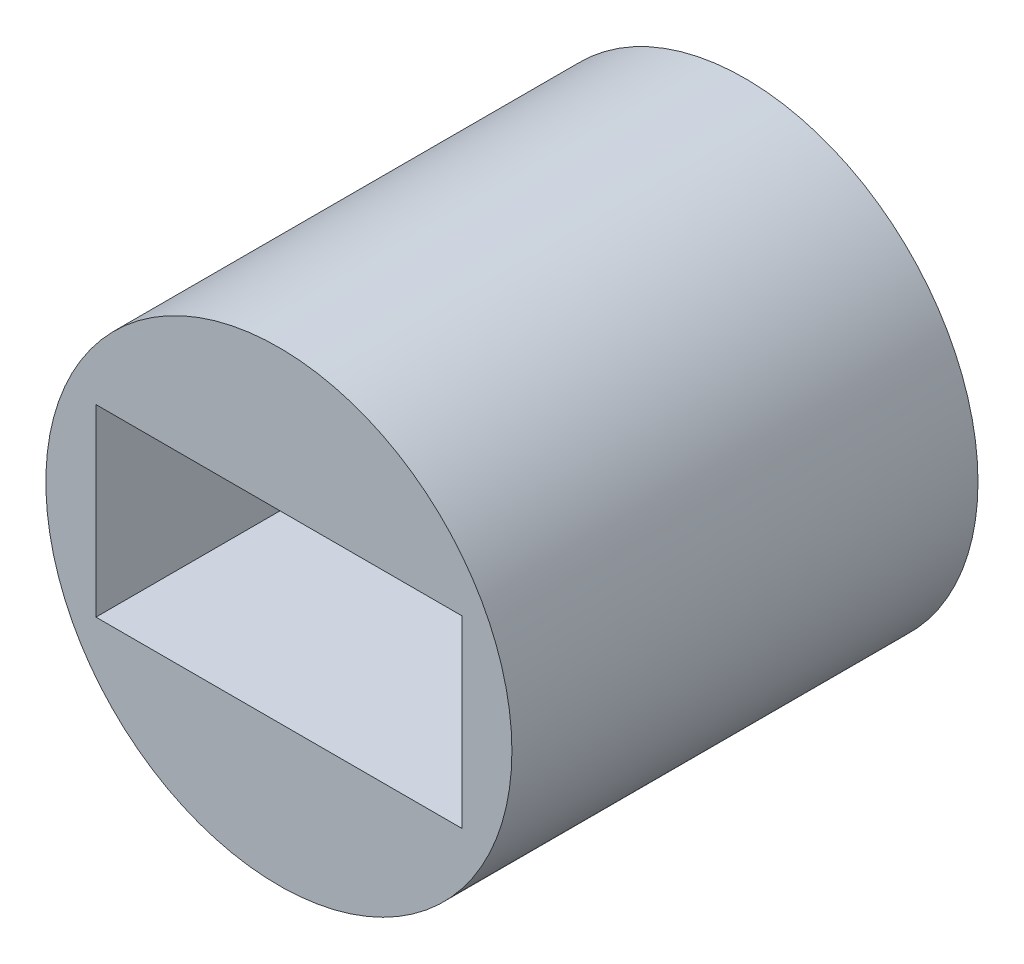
ISO-10303-21;
HEADER;
FILE_DESCRIPTION(('STEP AP214'),'2;1');
FILE_NAME('part.step','',(''),(''),'','','');
FILE_SCHEMA(('AUTOMOTIVE_DESIGN { 1 0 10303 214 1 1 1 1 }'));
ENDSEC;
DATA;
#1=APPLICATION_CONTEXT('core data for automotive mechanical design processes');
#2=APPLICATION_PROTOCOL_DEFINITION('international standard','automotive_design',2000,#1);
#3=PRODUCT_CONTEXT('',#1,'mechanical');
#4=PRODUCT('Part','Part','',(#3));
#5=PRODUCT_RELATED_PRODUCT_CATEGORY('part','',(#4));
#6=PRODUCT_DEFINITION_FORMATION('','',#4);
#7=PRODUCT_DEFINITION_CONTEXT('part definition',#1,'design');
#8=PRODUCT_DEFINITION('design','',#6,#7);
#9=PRODUCT_DEFINITION_SHAPE('','',#8);
#10=(LENGTH_UNIT() NAMED_UNIT(*) SI_UNIT(.MILLI.,.METRE.));
#11=(NAMED_UNIT(*) PLANE_ANGLE_UNIT() SI_UNIT($,.RADIAN.));
#12=(NAMED_UNIT(*) SI_UNIT($,.STERADIAN.) SOLID_ANGLE_UNIT());
#13=UNCERTAINTY_MEASURE_WITH_UNIT(LENGTH_MEASURE(1.E-05),#10,'distance_accuracy_value','');
#14=(GEOMETRIC_REPRESENTATION_CONTEXT(3) GLOBAL_UNCERTAINTY_ASSIGNED_CONTEXT((#13)) GLOBAL_UNIT_ASSIGNED_CONTEXT((#10,
#11,#12)) REPRESENTATION_CONTEXT('',''));
#15=CARTESIAN_POINT('',(0.,0.,0.));
#16=DIRECTION('',(0.,0.,1.));
#17=DIRECTION('',(1.,0.,0.));
#18=AXIS2_PLACEMENT_3D('',#15,#16,#17);
#19=CARTESIAN_POINT('',(0.,0.,50.8));
#20=DIRECTION('',(0.,0.,-1.));
#21=DIRECTION('',(-1.,0.,0.));
#22=AXIS2_PLACEMENT_3D('',#19,#20,#21);
#23=CYLINDRICAL_SURFACE('',#22,25.4);
#24=CARTESIAN_POINT('',(0.,0.,50.8));
#25=DIRECTION('',(0.,0.,1.));
#26=DIRECTION('',(1.,0.,0.));
#27=AXIS2_PLACEMENT_3D('',#24,#25,#26);
#28=CIRCLE('',#27,25.4);
#29=CARTESIAN_POINT('',(25.4,0.,50.8));
#30=VERTEX_POINT('',#29);
#31=EDGE_CURVE('E11',#30,#30,#28,.T.);
#32=ORIENTED_EDGE('',*,*,#31,.F.);
#33=EDGE_LOOP('',(#32));
#34=FACE_BOUND('',#33,.T.);
#35=CARTESIAN_POINT('',(0.,0.,0.));
#36=DIRECTION('',(0.,0.,1.));
#37=DIRECTION('',(1.,0.,0.));
#38=AXIS2_PLACEMENT_3D('',#35,#36,#37);
#39=CIRCLE('',#38,25.4);
#40=CARTESIAN_POINT('',(25.4,0.,0.));
#41=VERTEX_POINT('',#40);
#42=EDGE_CURVE('E48',#41,#41,#39,.T.);
#43=ORIENTED_EDGE('',*,*,#42,.T.);
#44=EDGE_LOOP('',(#43));
#45=FACE_BOUND('',#44,.T.);
#46=ADVANCED_FACE('F45',(#34,#45),#23,.T.);
#47=CARTESIAN_POINT('',(0.,0.,50.8));
#48=DIRECTION('',(0.,0.,1.));
#49=DIRECTION('',(1.,0.,0.));
#50=AXIS2_PLACEMENT_3D('',#47,#48,#49);
#51=PLANE('',#50);
#52=DIRECTION('',(1.,0.,0.));
#53=VECTOR('',#52,1.);
#54=CARTESIAN_POINT('',(-19.939,-10.033,50.8));
#55=LINE('',#54,#53);
#56=CARTESIAN_POINT('',(-19.939,-10.033,50.8));
#57=VERTEX_POINT('',#56);
#58=CARTESIAN_POINT('',(19.939,-10.033,50.8));
#59=VERTEX_POINT('',#58);
#60=EDGE_CURVE('E60',#57,#59,#55,.T.);
#61=ORIENTED_EDGE('',*,*,#60,.F.);
#62=DIRECTION('',(0.,-1.,0.));
#63=VECTOR('',#62,1.);
#64=CARTESIAN_POINT('',(-19.939,10.033,50.8));
#65=LINE('',#64,#63);
#66=CARTESIAN_POINT('',(-19.939,10.033,50.8));
#67=VERTEX_POINT('',#66);
#68=EDGE_CURVE('E115',#67,#57,#65,.T.);
#69=ORIENTED_EDGE('',*,*,#68,.F.);
#70=DIRECTION('',(1.,0.,0.));
#71=VECTOR('',#70,1.);
#72=CARTESIAN_POINT('',(-19.939,10.033,50.8));
#73=LINE('',#72,#71);
#74=CARTESIAN_POINT('',(19.939,10.033,50.8));
#75=VERTEX_POINT('',#74);
#76=EDGE_CURVE('E124',#67,#75,#73,.T.);
#77=ORIENTED_EDGE('',*,*,#76,.T.);
#78=DIRECTION('',(0.,-1.,0.));
#79=VECTOR('',#78,1.);
#80=CARTESIAN_POINT('',(19.939,10.033,50.8));
#81=LINE('',#80,#79);
#82=EDGE_CURVE('E104',#75,#59,#81,.T.);
#83=ORIENTED_EDGE('',*,*,#82,.T.);
#84=EDGE_LOOP('',(#61,#69,#77,#83));
#85=FACE_BOUND('',#84,.T.);
#86=ORIENTED_EDGE('',*,*,#31,.T.);
#87=EDGE_LOOP('',(#86));
#88=FACE_BOUND('',#87,.T.);
#89=ADVANCED_FACE('F135',(#85,#88),#51,.T.);
#90=CARTESIAN_POINT('',(0.,0.,0.));
#91=DIRECTION('',(0.,0.,1.));
#92=DIRECTION('',(1.,0.,0.));
#93=AXIS2_PLACEMENT_3D('',#90,#91,#92);
#94=PLANE('',#93);
#95=ORIENTED_EDGE('',*,*,#42,.F.);
#96=EDGE_LOOP('',(#95));
#97=FACE_BOUND('',#96,.T.);
#98=ADVANCED_FACE('F147',(#97),#94,.F.);
#99=CARTESIAN_POINT('',(-19.939,-10.033,15.24));
#100=DIRECTION('',(0.,-1.,0.));
#101=DIRECTION('',(0.,0.,-1.));
#102=AXIS2_PLACEMENT_3D('',#99,#100,#101);
#103=PLANE('',#102);
#104=ORIENTED_EDGE('',*,*,#60,.T.);
#105=DIRECTION('',(0.,0.,1.));
#106=VECTOR('',#105,1.);
#107=CARTESIAN_POINT('',(19.939,-10.033,15.24));
#108=LINE('',#107,#106);
#109=CARTESIAN_POINT('',(19.939,-10.033,15.24));
#110=VERTEX_POINT('',#109);
#111=EDGE_CURVE('E107',#110,#59,#108,.T.);
#112=ORIENTED_EDGE('',*,*,#111,.F.);
#113=DIRECTION('',(1.,0.,0.));
#114=VECTOR('',#113,1.);
#115=CARTESIAN_POINT('',(-19.939,-10.033,15.24));
#116=LINE('',#115,#114);
#117=CARTESIAN_POINT('',(-19.939,-10.033,15.24));
#118=VERTEX_POINT('',#117);
#119=EDGE_CURVE('E111',#118,#110,#116,.T.);
#120=ORIENTED_EDGE('',*,*,#119,.F.);
#121=DIRECTION('',(0.,0.,1.));
#122=VECTOR('',#121,1.);
#123=CARTESIAN_POINT('',(-19.939,-10.033,15.24));
#124=LINE('',#123,#122);
#125=EDGE_CURVE('E68',#118,#57,#124,.T.);
#126=ORIENTED_EDGE('',*,*,#125,.T.);
#127=EDGE_LOOP('',(#104,#112,#120,#126));
#128=FACE_BOUND('',#127,.T.);
#129=ADVANCED_FACE('F140',(#128),#103,.F.);
#130=CARTESIAN_POINT('',(-19.939,10.033,15.24));
#131=DIRECTION('',(-1.,0.,0.));
#132=DIRECTION('',(0.,-1.,0.));
#133=AXIS2_PLACEMENT_3D('',#130,#131,#132);
#134=PLANE('',#133);
#135=ORIENTED_EDGE('',*,*,#68,.T.);
#136=ORIENTED_EDGE('',*,*,#125,.F.);
#137=DIRECTION('',(0.,-1.,0.));
#138=VECTOR('',#137,1.);
#139=CARTESIAN_POINT('',(-19.939,10.033,15.24));
#140=LINE('',#139,#138);
#141=CARTESIAN_POINT('',(-19.939,10.033,15.24));
#142=VERTEX_POINT('',#141);
#143=EDGE_CURVE('E100',#142,#118,#140,.T.);
#144=ORIENTED_EDGE('',*,*,#143,.F.);
#145=DIRECTION('',(0.,0.,1.));
#146=VECTOR('',#145,1.);
#147=CARTESIAN_POINT('',(-19.939,10.033,15.24));
#148=LINE('',#147,#146);
#149=EDGE_CURVE('E96',#142,#67,#148,.T.);
#150=ORIENTED_EDGE('',*,*,#149,.T.);
#151=EDGE_LOOP('',(#135,#136,#144,#150));
#152=FACE_BOUND('',#151,.T.);
#153=ADVANCED_FACE('F138',(#152),#134,.F.);
#154=CARTESIAN_POINT('',(-19.939,10.033,15.24));
#155=DIRECTION('',(0.,-1.,0.));
#156=DIRECTION('',(0.,0.,-1.));
#157=AXIS2_PLACEMENT_3D('',#154,#155,#156);
#158=PLANE('',#157);
#159=ORIENTED_EDGE('',*,*,#76,.F.);
#160=ORIENTED_EDGE('',*,*,#149,.F.);
#161=DIRECTION('',(1.,0.,0.));
#162=VECTOR('',#161,1.);
#163=CARTESIAN_POINT('',(-19.939,10.033,15.24));
#164=LINE('',#163,#162);
#165=CARTESIAN_POINT('',(19.939,10.033,15.24));
#166=VERTEX_POINT('',#165);
#167=EDGE_CURVE('E91',#142,#166,#164,.T.);
#168=ORIENTED_EDGE('',*,*,#167,.T.);
#169=DIRECTION('',(0.,0.,1.));
#170=VECTOR('',#169,1.);
#171=CARTESIAN_POINT('',(19.939,10.033,15.24));
#172=LINE('',#171,#170);
#173=EDGE_CURVE('E94',#166,#75,#172,.T.);
#174=ORIENTED_EDGE('',*,*,#173,.T.);
#175=EDGE_LOOP('',(#159,#160,#168,#174));
#176=FACE_BOUND('',#175,.T.);
#177=ADVANCED_FACE('F93',(#176),#158,.T.);
#178=CARTESIAN_POINT('',(19.939,10.033,15.24));
#179=DIRECTION('',(-1.,0.,0.));
#180=DIRECTION('',(0.,0.,1.));
#181=AXIS2_PLACEMENT_3D('',#178,#179,#180);
#182=PLANE('',#181);
#183=ORIENTED_EDGE('',*,*,#82,.F.);
#184=ORIENTED_EDGE('',*,*,#173,.F.);
#185=DIRECTION('',(0.,-1.,0.));
#186=VECTOR('',#185,1.);
#187=CARTESIAN_POINT('',(19.939,10.033,15.24));
#188=LINE('',#187,#186);
#189=EDGE_CURVE('E87',#166,#110,#188,.T.);
#190=ORIENTED_EDGE('',*,*,#189,.T.);
#191=ORIENTED_EDGE('',*,*,#111,.T.);
#192=EDGE_LOOP('',(#183,#184,#190,#191));
#193=FACE_BOUND('',#192,.T.);
#194=ADVANCED_FACE('F102',(#193),#182,.T.);
#195=CARTESIAN_POINT('',(0.,0.,15.24));
#196=DIRECTION('',(0.,0.,-1.));
#197=DIRECTION('',(-1.,0.,0.));
#198=AXIS2_PLACEMENT_3D('',#195,#196,#197);
#199=PLANE('',#198);
#200=ORIENTED_EDGE('',*,*,#119,.T.);
#201=ORIENTED_EDGE('',*,*,#189,.F.);
#202=ORIENTED_EDGE('',*,*,#167,.F.);
#203=ORIENTED_EDGE('',*,*,#143,.T.);
#204=EDGE_LOOP('',(#200,#201,#202,#203));
#205=FACE_BOUND('',#204,.T.);
#206=ADVANCED_FACE('F110',(#205),#199,.F.);
#207=CLOSED_SHELL('',(#46,#89,#98,#129,#153,#177,#194,#206));
#208=MANIFOLD_SOLID_BREP('B2',#207);
#209=ADVANCED_BREP_SHAPE_REPRESENTATION('',(#18,#208),#14);
#210=SHAPE_DEFINITION_REPRESENTATION(#9,#209);
ENDSEC;
END-ISO-10303-21;
